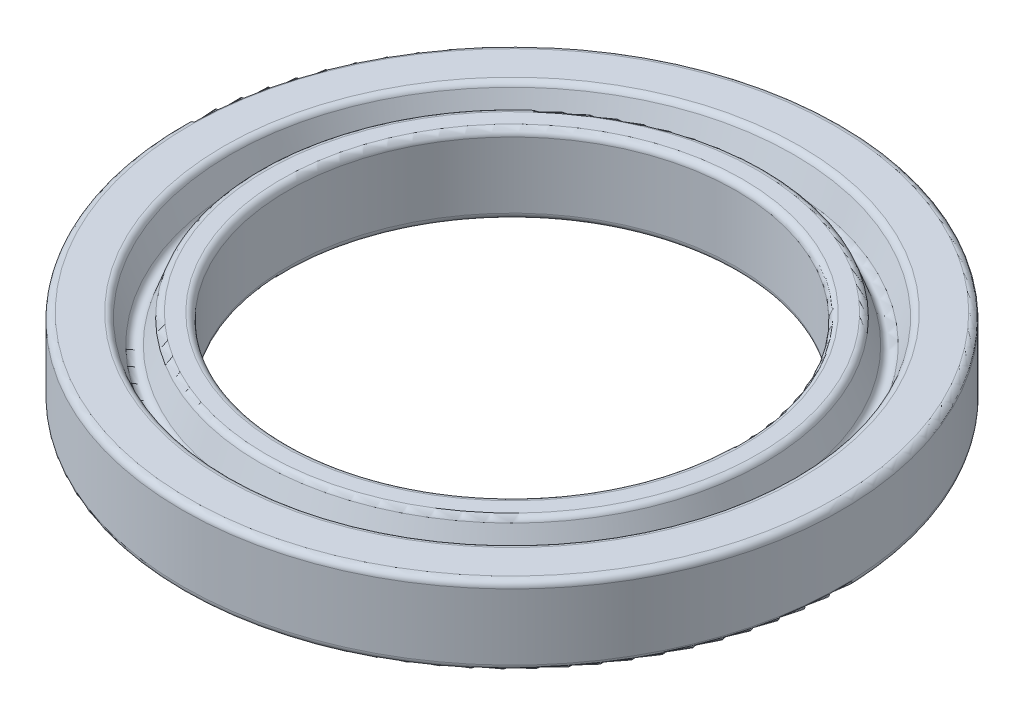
from build123d import *

# Parameters (mm, degrees)
CONG_1_R = 0.25


with BuildPart() as part:
    # Esquisse1 → Base-R_volution (revolve)
    with BuildSketch(Plane.XY, mode=Mode.PRIVATE) as base_r_volution_sk:
        Polygon((9.5, 2.5), (10.125, 0.782826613), (10.75, 2.5), (12.5, 2.5), (12.5, -0.5), (11.5, -0.5), (11.007053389, 0.854359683), (10.5, -0.5), (8.5, -0.5), (8.5, 2.5), align=None)
    revolve(base_r_volution_sk.sketch.rotate(Axis((0, 40, 0), (0, -1, 0)), 90), axis=Axis((0, 40, 0), (0, -1, 0)))

    # Cong_1
    cong_1_edges = [part.edges().sort_by_distance(p)[0] for p in [
        (0, 2.5, -9.5),
        (0, 0.782826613, -10.125),
        (0, 2.5, -10.75),
        (0, 2.5, -12.5),
        (0, -0.5, -12.5),
        (0, -0.5, -11.5),
        (0, 0.854359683, -11.007053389),
        (0, -0.5, -10.5),
        (0, -0.5, -8.5),
        (0, 2.5, -8.5),
    ]]
    fillet(cong_1_edges, radius=CONG_1_R)


solid = part.part
